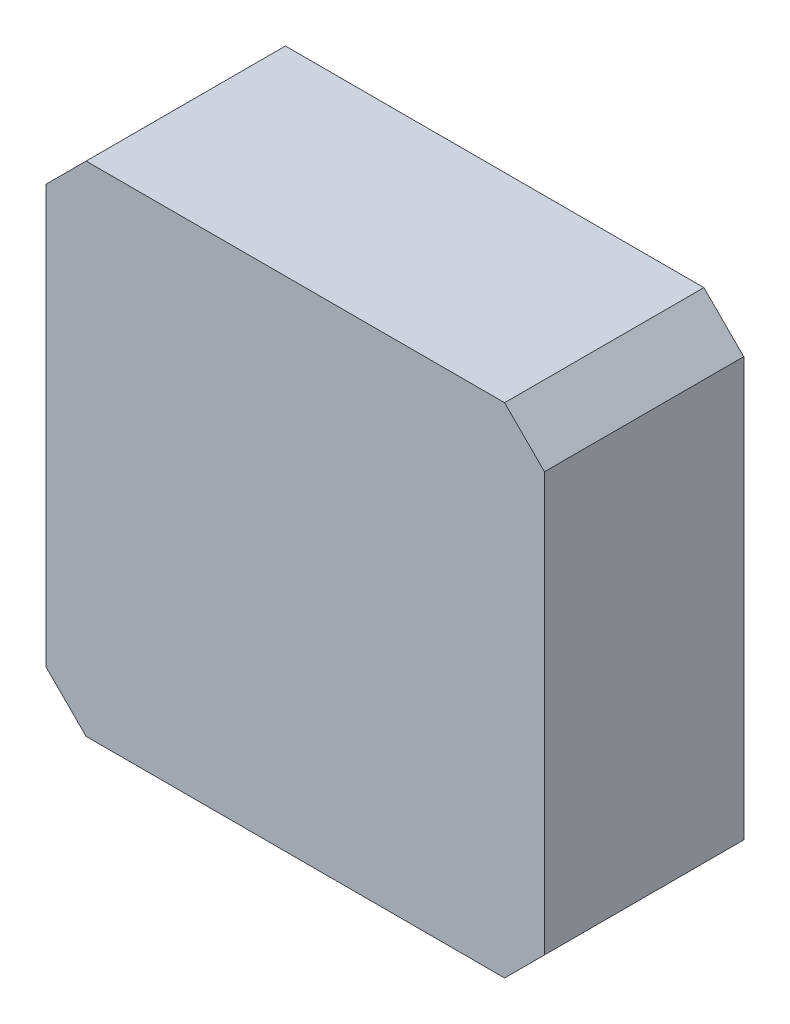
from build123d import *

# Parameters (mm, degrees)
SKETCH1_W      = 25
SKETCH1_H      = 25
EXTRUDE1_DEPTH = 10
CHAMFER1_SIZE  = 2


with BuildPart() as part:
    # Sketch1 → Extrude1 (new body)
    with BuildSketch(Plane.XY):
        with Locations((12.5, 12.5)):
            Rectangle(SKETCH1_W, SKETCH1_H)
    extrude(amount=EXTRUDE1_DEPTH)

    # Chamfer1
    chamfer1_edges = [part.edges().sort_by_distance(p)[0] for p in [
        (0, 25, 5),
        (25, 25, 5),
        (25, 0, 5),
        (0, 0, 5),
    ]]
    chamfer(chamfer1_edges, length=CHAMFER1_SIZE)


solid = part.part
